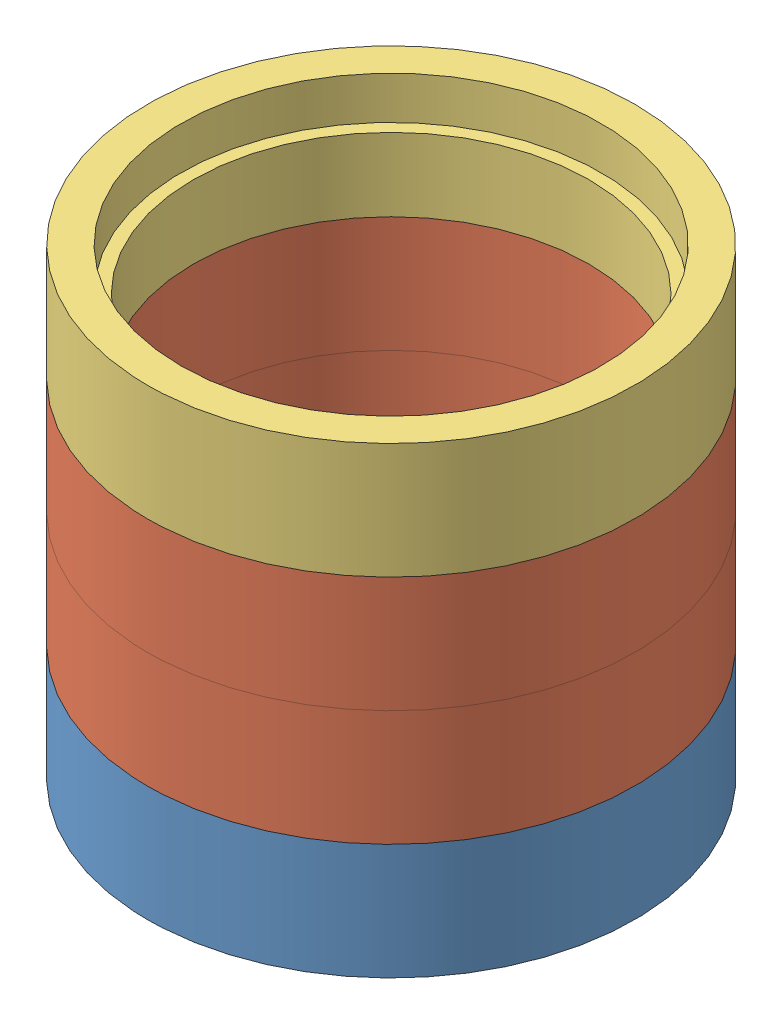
SolidWorks assembly Ensamblaje1.sldasm, configuration Predeterminado (file format 9000). Lengths in mm.
Overall size (80 76 80).
4 component instances, 3 part files, 6 mates.
Components (placement in the parent):
- Pieza1-1: Pieza1.SLDPRT [Predeterminado] at (-7.734 -7.9779 80) size (80 19 80)
- Pieza2-1: Pieza2.SLDPRT [Predeterminado] at (-7.734 11.0221 80) size (80 19 80)
- Pieza4-1: Pieza4.SLDPRT [Predeterminado] at (-7.734 49.0221 80) size (80 19 80)
- Pieza2-2: Pieza2.SLDPRT [Predeterminado] at (-7.734 30.0221 80) size (80 19 80)
Mates (geometry in assembly coordinates):
- Coincidente1: coincident: plane of Pieza1-1 through (-7.734 11.0221 80) normal (0 1 0); plane of Pieza2-1 through (-7.734 11.0221 80) normal (0 -1 0)
- Concéntrica1: concentric aligned: cylinder of Pieza1-1 through (-7.734 -44.9779 80) axis (0 1 0) radius 32.5; cylinder of Pieza2-1 through (-7.734 11.0221 80) axis (0 1 0) radius 32.5
- Coincidente2: coincident: plane of Pieza2-1 through (-7.734 30.0221 80) normal (0 1 0); plane of Pieza2-2 through (-7.734 30.0221 80) normal (0 -1 0)
- Concéntrica2: concentric aligned: cylinder of Pieza2-1 through (-7.734 11.0221 80) axis (0 1 0) radius 32.5; cylinder of Pieza2-2 through (-7.734 30.0221 80) axis (0 1 0) radius 32.5
- Coincidente3: coincident: plane of Pieza4-1 through (-7.734 49.0221 80) normal (0 -1 0); plane of Pieza2-2 through (-7.734 49.0221 80) normal (0 1 0)
- Concéntrica3: concentric aligned: cylinder of Pieza4-1 through (-7.734 49.0221 80) axis (0 1 0) radius 32.5; cylinder of Pieza2-2 through (-7.734 30.0221 80) axis (0 1 0) radius 32.5
